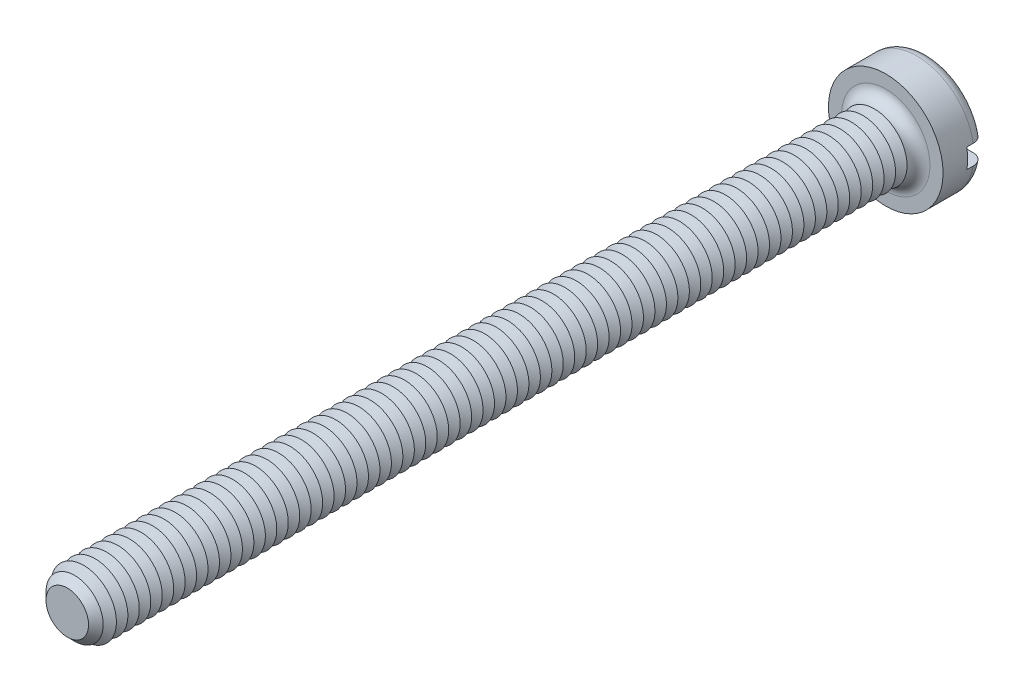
from build123d import *

# Parameters (mm, degrees)
SKETCH3_R           = 3.5
BOSS_EXTRUDE2_DEPTH = 2.6
SKETCH4_R           = 2
BOSS_EXTRUDE3_DEPTH = 50
FILLET1_R           = 0.7
CHAMFER1_SIZE       = 0.7
LPATTERN1_COUNT     = 70
LPATTERN1_PITCH     = 0.7
SKETCH8_W           = 7
SKETCH8_H           = 1.2
CUT_EXTRUDE1_DEPTH  = 1.1


with BuildPart() as part:
    # Sketch3 → Boss-Extrude2 (new body)
    with BuildSketch(Plane.XY):
        Circle(SKETCH3_R)
    extrude(amount=-BOSS_EXTRUDE2_DEPTH)

    # Sketch4 → Boss-Extrude3 (add)
    with BuildSketch(Plane.XY):
        Circle(SKETCH4_R)
    extrude(amount=BOSS_EXTRUDE3_DEPTH)

    # Fillet1
    fillet1_edges = [part.edges().sort_by_distance(p)[0] for p in [
        (-3.5, 0, -2.6),
        (-2, 0, 0),
    ]]
    fillet(fillet1_edges, radius=FILLET1_R)

    # Chamfer1
    chamfer1_edges = [part.edges().sort_by_distance(p)[0] for p in [
        (-2, 0, 50),
    ]]
    chamfer(chamfer1_edges, length=CHAMFER1_SIZE)

    # Sketch6 → Cut-Revolve1 (revolve, cut)
    with BuildSketch(Plane(origin=(0, 0, 0), x_dir=(0, 0, -1), z_dir=(1, 0, 0)), mode=Mode.PRIVATE) as cut_revolve1_sk:
        Polygon((-0.7, 2), (-1.05, 1.393782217), (-1.4, 2), align=None)
    cut_revolve1 = revolve(cut_revolve1_sk.sketch.rotate(Axis((0, 0, -1.694361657), (0, 0, 1)), 90), axis=Axis((0, 0, -1.694361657), (0, 0, 1)), mode=Mode.SUBTRACT)

    # LPattern1: Cut-Revolve1 ×70
    with Locations(*[(0, 0, i * LPATTERN1_PITCH) for i in range(1, LPATTERN1_COUNT)]):
        add(cut_revolve1, mode=Mode.SUBTRACT)

    # Sketch8 → Cut-Extrude1 (cut)
    with BuildSketch(Plane(origin=(0, 0, -2.6), x_dir=(-1, 0, 0), z_dir=(0, 0, -1))):
        Rectangle(SKETCH8_W, SKETCH8_H)
    extrude(amount=-CUT_EXTRUDE1_DEPTH, mode=Mode.SUBTRACT)


solid = part.part
